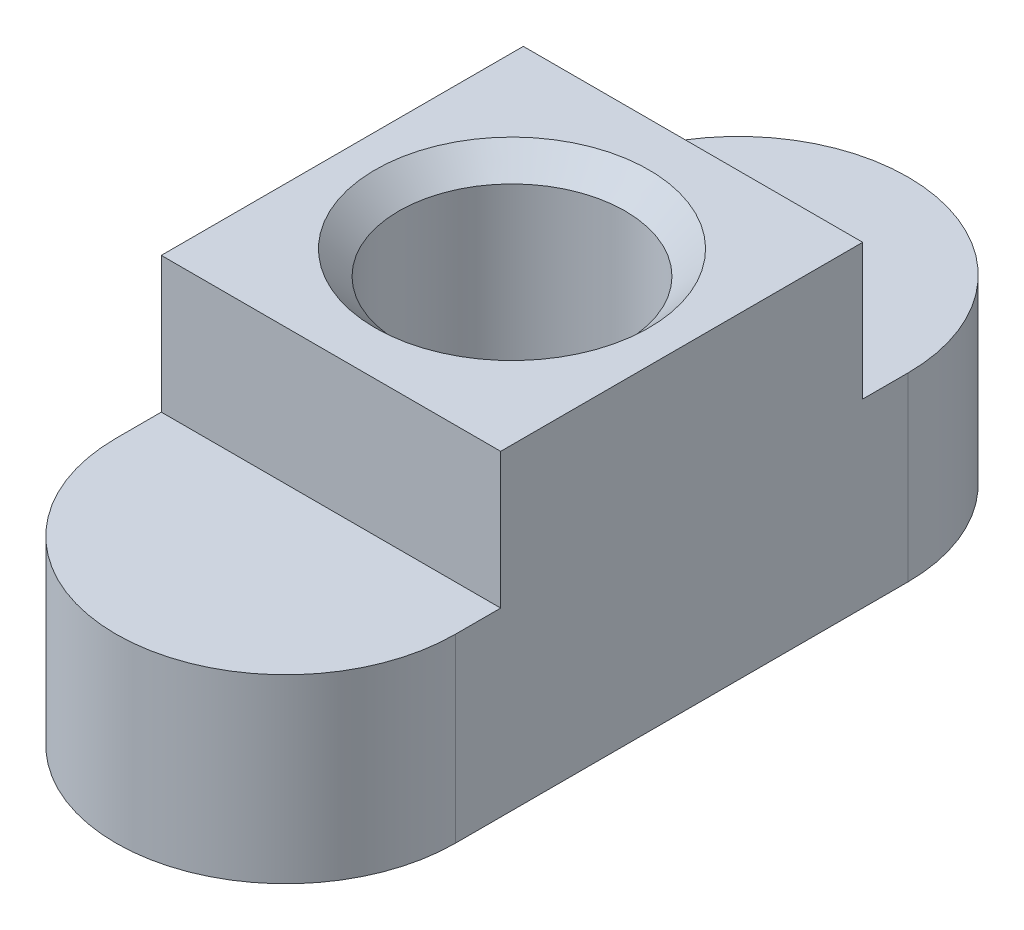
from build123d import *

# Parameters (mm, degrees)
AUFSATZ_LINEAR_AUSTRAGEN1_DEPTH = 4
SKIZZE2_W                       = 7.5
SKIZZE2_H                       = 8
AUFSATZ_LINEAR_AUSTRAGEN2_DEPTH = 3
M6_GEWINDEBOHRUNG1_D            = 5
M6_GEWINDEBOHRUNG1_CSINK_D      = 6.05
M6_GEWINDEBOHRUNG1_CSINK_ANGLE  = 90


with BuildPart() as part:
    # Skizze1 → Aufsatz-Linear austragen1 (new body)
    with BuildSketch(Plane(origin=(0, 0, 0), x_dir=(1, 0, 0), z_dir=(0, 1, 0))):
        with BuildLine():
            Line((-3.75, -5), (-3.75, 5))
            ThreePointArc((-3.75, 5), (0, 8.75), (3.75, 5))
            Line((3.75, 5), (3.75, -5))
            ThreePointArc((3.75, -5), (0, -8.75), (-3.75, -5))
        make_face()
    extrude(amount=AUFSATZ_LINEAR_AUSTRAGEN1_DEPTH)

    # Skizze2 → Aufsatz-Linear austragen2 (add)
    with BuildSketch(Plane(origin=(0, 4, 0), x_dir=(1, 0, 0), z_dir=(0, 1, 0))):
        Rectangle(SKIZZE2_W, SKIZZE2_H)
    extrude(amount=AUFSATZ_LINEAR_AUSTRAGEN2_DEPTH)

    # M6 Gewindebohrung1 (through all)
    with Locations(Plane(origin=(0, 7, 0), x_dir=(1, 0, 0), z_dir=(0, 1, 0))):
        with Locations((0, 0)):
            CounterSinkHole(M6_GEWINDEBOHRUNG1_D / 2, M6_GEWINDEBOHRUNG1_CSINK_D / 2, counter_sink_angle=M6_GEWINDEBOHRUNG1_CSINK_ANGLE)


solid = part.part
